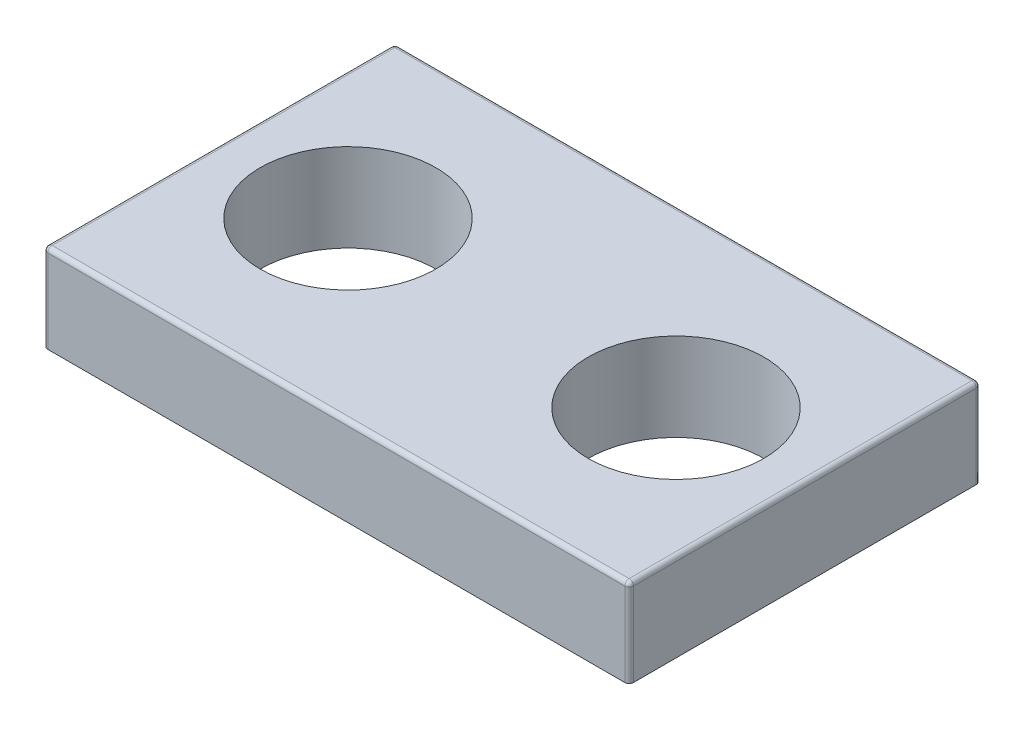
ISO-10303-21;
HEADER;
FILE_DESCRIPTION(('STEP AP214'),'2;1');
FILE_NAME('part.step','',(''),(''),'','','');
FILE_SCHEMA(('AUTOMOTIVE_DESIGN { 1 0 10303 214 1 1 1 1 }'));
ENDSEC;
DATA;
#1=APPLICATION_CONTEXT('core data for automotive mechanical design processes');
#2=APPLICATION_PROTOCOL_DEFINITION('international standard','automotive_design',2000,#1);
#3=PRODUCT_CONTEXT('',#1,'mechanical');
#4=PRODUCT('Part','Part','',(#3));
#5=PRODUCT_RELATED_PRODUCT_CATEGORY('part','',(#4));
#6=PRODUCT_DEFINITION_FORMATION('','',#4);
#7=PRODUCT_DEFINITION_CONTEXT('part definition',#1,'design');
#8=PRODUCT_DEFINITION('design','',#6,#7);
#9=PRODUCT_DEFINITION_SHAPE('','',#8);
#10=(LENGTH_UNIT() NAMED_UNIT(*) SI_UNIT(.MILLI.,.METRE.));
#11=(NAMED_UNIT(*) PLANE_ANGLE_UNIT() SI_UNIT($,.RADIAN.));
#12=(NAMED_UNIT(*) SI_UNIT($,.STERADIAN.) SOLID_ANGLE_UNIT());
#13=UNCERTAINTY_MEASURE_WITH_UNIT(LENGTH_MEASURE(1.E-05),#10,'distance_accuracy_value','');
#14=(GEOMETRIC_REPRESENTATION_CONTEXT(3) GLOBAL_UNCERTAINTY_ASSIGNED_CONTEXT((#13)) GLOBAL_UNIT_ASSIGNED_CONTEXT((#10,
#11,#12)) REPRESENTATION_CONTEXT('',''));
#15=CARTESIAN_POINT('',(0.,0.,0.));
#16=DIRECTION('',(0.,0.,1.));
#17=DIRECTION('',(1.,0.,0.));
#18=AXIS2_PLACEMENT_3D('',#15,#16,#17);
#19=CARTESIAN_POINT('',(0.,15.,0.));
#20=DIRECTION('',(0.,-1.,0.));
#21=DIRECTION('',(0.,0.,-1.));
#22=AXIS2_PLACEMENT_3D('',#19,#20,#21);
#23=PLANE('',#22);
#24=DIRECTION('',(1.,0.,0.));
#25=VECTOR('',#24,1.);
#26=CARTESIAN_POINT('',(0.,15.,29.25));
#27=LINE('',#26,#25);
#28=CARTESIAN_POINT('',(-49.25,15.,29.25));
#29=VERTEX_POINT('',#28);
#30=CARTESIAN_POINT('',(49.25,15.,29.25));
#31=VERTEX_POINT('',#30);
#32=EDGE_CURVE('E43',#29,#31,#27,.T.);
#33=ORIENTED_EDGE('',*,*,#32,.T.);
#34=DIRECTION('',(0.,0.,-1.));
#35=VECTOR('',#34,1.);
#36=CARTESIAN_POINT('',(49.25,15.,0.));
#37=LINE('',#36,#35);
#38=CARTESIAN_POINT('',(49.25,15.,-29.25));
#39=VERTEX_POINT('',#38);
#40=EDGE_CURVE('E11',#31,#39,#37,.T.);
#41=ORIENTED_EDGE('',*,*,#40,.T.);
#42=DIRECTION('',(-1.,0.,0.));
#43=VECTOR('',#42,1.);
#44=CARTESIAN_POINT('',(0.,15.,-29.25));
#45=LINE('',#44,#43);
#46=CARTESIAN_POINT('',(-49.25,15.,-29.25));
#47=VERTEX_POINT('',#46);
#48=EDGE_CURVE('E171',#39,#47,#45,.T.);
#49=ORIENTED_EDGE('',*,*,#48,.T.);
#50=DIRECTION('',(0.,0.,1.));
#51=VECTOR('',#50,1.);
#52=CARTESIAN_POINT('',(-49.25,15.,0.));
#53=LINE('',#52,#51);
#54=EDGE_CURVE('E169',#47,#29,#53,.T.);
#55=ORIENTED_EDGE('',*,*,#54,.T.);
#56=EDGE_LOOP('',(#33,#41,#49,#55));
#57=FACE_BOUND('',#56,.T.);
#58=CARTESIAN_POINT('',(-28.,15.,0.));
#59=DIRECTION('',(0.,1.,0.));
#60=DIRECTION('',(0.,0.,1.));
#61=AXIS2_PLACEMENT_3D('',#58,#59,#60);
#62=CIRCLE('',#61,15.);
#63=CARTESIAN_POINT('',(-28.,15.,15.));
#64=VERTEX_POINT('',#63);
#65=EDGE_CURVE('E217',#64,#64,#62,.T.);
#66=ORIENTED_EDGE('',*,*,#65,.F.);
#67=EDGE_LOOP('',(#66));
#68=FACE_BOUND('',#67,.T.);
#69=CARTESIAN_POINT('',(28.,15.,0.));
#70=DIRECTION('',(0.,1.,0.));
#71=DIRECTION('',(0.,0.,1.));
#72=AXIS2_PLACEMENT_3D('',#69,#70,#71);
#73=CIRCLE('',#72,15.);
#74=CARTESIAN_POINT('',(28.,15.,15.));
#75=VERTEX_POINT('',#74);
#76=EDGE_CURVE('E210',#75,#75,#73,.T.);
#77=ORIENTED_EDGE('',*,*,#76,.F.);
#78=EDGE_LOOP('',(#77));
#79=FACE_BOUND('',#78,.T.);
#80=ADVANCED_FACE('F34',(#57,#68,#79),#23,.F.);
#81=CARTESIAN_POINT('',(0.,0.,0.));
#82=DIRECTION('',(0.,-1.,0.));
#83=DIRECTION('',(0.,0.,-1.));
#84=AXIS2_PLACEMENT_3D('',#81,#82,#83);
#85=PLANE('',#84);
#86=CARTESIAN_POINT('',(-28.,0.,0.));
#87=DIRECTION('',(0.,1.,0.));
#88=DIRECTION('',(0.,0.,1.));
#89=AXIS2_PLACEMENT_3D('',#86,#87,#88);
#90=CIRCLE('',#89,15.);
#91=CARTESIAN_POINT('',(-28.,0.,15.));
#92=VERTEX_POINT('',#91);
#93=EDGE_CURVE('E214',#92,#92,#90,.T.);
#94=ORIENTED_EDGE('',*,*,#93,.T.);
#95=EDGE_LOOP('',(#94));
#96=FACE_BOUND('',#95,.T.);
#97=DIRECTION('',(1.,0.,0.));
#98=VECTOR('',#97,1.);
#99=CARTESIAN_POINT('',(-50.,0.,30.));
#100=LINE('',#99,#98);
#101=CARTESIAN_POINT('',(-49.25,0.,30.));
#102=VERTEX_POINT('',#101);
#103=CARTESIAN_POINT('',(49.25,0.,30.));
#104=VERTEX_POINT('',#103);
#105=EDGE_CURVE('E130',#102,#104,#100,.T.);
#106=ORIENTED_EDGE('',*,*,#105,.F.);
#107=CARTESIAN_POINT('',(-49.25,0.,29.25));
#108=DIRECTION('',(0.,-1.,0.));
#109=DIRECTION('',(0.,0.,-1.));
#110=AXIS2_PLACEMENT_3D('',#107,#108,#109);
#111=CIRCLE('',#110,0.75);
#112=CARTESIAN_POINT('',(-50.,0.,29.25));
#113=VERTEX_POINT('',#112);
#114=EDGE_CURVE('E114',#102,#113,#111,.T.);
#115=ORIENTED_EDGE('',*,*,#114,.T.);
#116=DIRECTION('',(0.,0.,1.));
#117=VECTOR('',#116,1.);
#118=CARTESIAN_POINT('',(-50.,0.,30.));
#119=LINE('',#118,#117);
#120=CARTESIAN_POINT('',(-50.,0.,-29.25));
#121=VERTEX_POINT('',#120);
#122=EDGE_CURVE('E141',#121,#113,#119,.T.);
#123=ORIENTED_EDGE('',*,*,#122,.F.);
#124=CARTESIAN_POINT('',(-49.25,0.,-29.25));
#125=DIRECTION('',(0.,-1.,0.));
#126=DIRECTION('',(0.,0.,-1.));
#127=AXIS2_PLACEMENT_3D('',#124,#125,#126);
#128=CIRCLE('',#127,0.75);
#129=CARTESIAN_POINT('',(-49.25,0.,-30.));
#130=VERTEX_POINT('',#129);
#131=EDGE_CURVE('E125',#121,#130,#128,.T.);
#132=ORIENTED_EDGE('',*,*,#131,.T.);
#133=DIRECTION('',(-1.,0.,0.));
#134=VECTOR('',#133,1.);
#135=CARTESIAN_POINT('',(-50.,0.,-30.));
#136=LINE('',#135,#134);
#137=CARTESIAN_POINT('',(49.25,0.,-30.));
#138=VERTEX_POINT('',#137);
#139=EDGE_CURVE('E144',#138,#130,#136,.T.);
#140=ORIENTED_EDGE('',*,*,#139,.F.);
#141=CARTESIAN_POINT('',(49.25,0.,-29.25));
#142=DIRECTION('',(0.,-1.,0.));
#143=DIRECTION('',(0.,0.,-1.));
#144=AXIS2_PLACEMENT_3D('',#141,#142,#143);
#145=CIRCLE('',#144,0.75);
#146=CARTESIAN_POINT('',(50.,0.,-29.25));
#147=VERTEX_POINT('',#146);
#148=EDGE_CURVE('E150',#138,#147,#145,.T.);
#149=ORIENTED_EDGE('',*,*,#148,.T.);
#150=DIRECTION('',(0.,0.,-1.));
#151=VECTOR('',#150,1.);
#152=CARTESIAN_POINT('',(50.,0.,30.));
#153=LINE('',#152,#151);
#154=CARTESIAN_POINT('',(50.,0.,29.25));
#155=VERTEX_POINT('',#154);
#156=EDGE_CURVE('E220',#155,#147,#153,.T.);
#157=ORIENTED_EDGE('',*,*,#156,.F.);
#158=CARTESIAN_POINT('',(49.25,0.,29.25));
#159=DIRECTION('',(0.,-1.,0.));
#160=DIRECTION('',(0.,0.,-1.));
#161=AXIS2_PLACEMENT_3D('',#158,#159,#160);
#162=CIRCLE('',#161,0.75);
#163=EDGE_CURVE('E134',#155,#104,#162,.T.);
#164=ORIENTED_EDGE('',*,*,#163,.T.);
#165=EDGE_LOOP('',(#106,#115,#123,#132,#140,#149,#157,#164));
#166=FACE_BOUND('',#165,.T.);
#167=CARTESIAN_POINT('',(28.,0.,0.));
#168=DIRECTION('',(0.,1.,0.));
#169=DIRECTION('',(0.,0.,1.));
#170=AXIS2_PLACEMENT_3D('',#167,#168,#169);
#171=CIRCLE('',#170,15.);
#172=CARTESIAN_POINT('',(28.,0.,15.));
#173=VERTEX_POINT('',#172);
#174=EDGE_CURVE('E205',#173,#173,#171,.T.);
#175=ORIENTED_EDGE('',*,*,#174,.T.);
#176=EDGE_LOOP('',(#175));
#177=FACE_BOUND('',#176,.T.);
#178=ADVANCED_FACE('F137',(#96,#166,#177),#85,.T.);
#179=CARTESIAN_POINT('',(50.,15.,30.));
#180=DIRECTION('',(-1.,0.,0.));
#181=DIRECTION('',(0.,0.,1.));
#182=AXIS2_PLACEMENT_3D('',#179,#180,#181);
#183=PLANE('',#182);
#184=ORIENTED_EDGE('',*,*,#156,.T.);
#185=DIRECTION('',(0.,-1.,0.));
#186=VECTOR('',#185,1.);
#187=CARTESIAN_POINT('',(50.,15.,-29.25));
#188=LINE('',#187,#186);
#189=CARTESIAN_POINT('',(50.,14.25,-29.25));
#190=VERTEX_POINT('',#189);
#191=EDGE_CURVE('E167',#147,#190,#188,.F.);
#192=ORIENTED_EDGE('',*,*,#191,.T.);
#193=DIRECTION('',(0.,0.,-1.));
#194=VECTOR('',#193,1.);
#195=CARTESIAN_POINT('',(50.,14.25,30.));
#196=LINE('',#195,#194);
#197=CARTESIAN_POINT('',(50.,14.25,29.25));
#198=VERTEX_POINT('',#197);
#199=EDGE_CURVE('E163',#190,#198,#196,.F.);
#200=ORIENTED_EDGE('',*,*,#199,.T.);
#201=DIRECTION('',(0.,-1.,0.));
#202=VECTOR('',#201,1.);
#203=CARTESIAN_POINT('',(50.,15.,29.25));
#204=LINE('',#203,#202);
#205=EDGE_CURVE('E165',#198,#155,#204,.T.);
#206=ORIENTED_EDGE('',*,*,#205,.T.);
#207=EDGE_LOOP('',(#184,#192,#200,#206));
#208=FACE_BOUND('',#207,.T.);
#209=ADVANCED_FACE('F245',(#208),#183,.F.);
#210=CARTESIAN_POINT('',(-50.,15.,-30.));
#211=DIRECTION('',(0.,0.,1.));
#212=DIRECTION('',(1.,0.,0.));
#213=AXIS2_PLACEMENT_3D('',#210,#211,#212);
#214=PLANE('',#213);
#215=ORIENTED_EDGE('',*,*,#139,.T.);
#216=DIRECTION('',(0.,-1.,0.));
#217=VECTOR('',#216,1.);
#218=CARTESIAN_POINT('',(-49.25,15.,-30.));
#219=LINE('',#218,#217);
#220=CARTESIAN_POINT('',(-49.25,14.25,-30.));
#221=VERTEX_POINT('',#220);
#222=EDGE_CURVE('E161',#130,#221,#219,.F.);
#223=ORIENTED_EDGE('',*,*,#222,.T.);
#224=DIRECTION('',(-1.,0.,0.));
#225=VECTOR('',#224,1.);
#226=CARTESIAN_POINT('',(-50.,14.25,-30.));
#227=LINE('',#226,#225);
#228=CARTESIAN_POINT('',(49.25,14.25,-30.));
#229=VERTEX_POINT('',#228);
#230=EDGE_CURVE('E157',#221,#229,#227,.F.);
#231=ORIENTED_EDGE('',*,*,#230,.T.);
#232=DIRECTION('',(0.,-1.,0.));
#233=VECTOR('',#232,1.);
#234=CARTESIAN_POINT('',(49.25,15.,-30.));
#235=LINE('',#234,#233);
#236=EDGE_CURVE('E159',#229,#138,#235,.T.);
#237=ORIENTED_EDGE('',*,*,#236,.T.);
#238=EDGE_LOOP('',(#215,#223,#231,#237));
#239=FACE_BOUND('',#238,.T.);
#240=ADVANCED_FACE('F228',(#239),#214,.F.);
#241=CARTESIAN_POINT('',(-50.,15.,30.));
#242=DIRECTION('',(1.,0.,0.));
#243=DIRECTION('',(0.,0.,-1.));
#244=AXIS2_PLACEMENT_3D('',#241,#242,#243);
#245=PLANE('',#244);
#246=ORIENTED_EDGE('',*,*,#122,.T.);
#247=DIRECTION('',(0.,-1.,0.));
#248=VECTOR('',#247,1.);
#249=CARTESIAN_POINT('',(-50.,15.,29.25));
#250=LINE('',#249,#248);
#251=CARTESIAN_POINT('',(-50.,14.25,29.25));
#252=VERTEX_POINT('',#251);
#253=EDGE_CURVE('E119',#113,#252,#250,.F.);
#254=ORIENTED_EDGE('',*,*,#253,.T.);
#255=DIRECTION('',(0.,0.,1.));
#256=VECTOR('',#255,1.);
#257=CARTESIAN_POINT('',(-50.,14.25,30.));
#258=LINE('',#257,#256);
#259=CARTESIAN_POINT('',(-50.,14.25,-29.25));
#260=VERTEX_POINT('',#259);
#261=EDGE_CURVE('E124',#252,#260,#258,.F.);
#262=ORIENTED_EDGE('',*,*,#261,.T.);
#263=DIRECTION('',(0.,-1.,0.));
#264=VECTOR('',#263,1.);
#265=CARTESIAN_POINT('',(-50.,15.,-29.25));
#266=LINE('',#265,#264);
#267=EDGE_CURVE('E154',#260,#121,#266,.T.);
#268=ORIENTED_EDGE('',*,*,#267,.T.);
#269=EDGE_LOOP('',(#246,#254,#262,#268));
#270=FACE_BOUND('',#269,.T.);
#271=ADVANCED_FACE('F265',(#270),#245,.F.);
#272=CARTESIAN_POINT('',(-50.,15.,30.));
#273=DIRECTION('',(0.,0.,-1.));
#274=DIRECTION('',(-1.,0.,0.));
#275=AXIS2_PLACEMENT_3D('',#272,#273,#274);
#276=PLANE('',#275);
#277=DIRECTION('',(1.,0.,0.));
#278=VECTOR('',#277,1.);
#279=CARTESIAN_POINT('',(-50.,14.25,30.));
#280=LINE('',#279,#278);
#281=CARTESIAN_POINT('',(49.25,14.25,30.));
#282=VERTEX_POINT('',#281);
#283=CARTESIAN_POINT('',(-49.25,14.25,30.));
#284=VERTEX_POINT('',#283);
#285=EDGE_CURVE('E132',#282,#284,#280,.F.);
#286=ORIENTED_EDGE('',*,*,#285,.T.);
#287=DIRECTION('',(0.,-1.,0.));
#288=VECTOR('',#287,1.);
#289=CARTESIAN_POINT('',(-49.25,15.,30.));
#290=LINE('',#289,#288);
#291=EDGE_CURVE('E118',#284,#102,#290,.T.);
#292=ORIENTED_EDGE('',*,*,#291,.T.);
#293=ORIENTED_EDGE('',*,*,#105,.T.);
#294=DIRECTION('',(0.,-1.,0.));
#295=VECTOR('',#294,1.);
#296=CARTESIAN_POINT('',(49.25,15.,30.));
#297=LINE('',#296,#295);
#298=EDGE_CURVE('E135',#104,#282,#297,.F.);
#299=ORIENTED_EDGE('',*,*,#298,.T.);
#300=EDGE_LOOP('',(#286,#292,#293,#299));
#301=FACE_BOUND('',#300,.T.);
#302=ADVANCED_FACE('F129',(#301),#276,.F.);
#303=CARTESIAN_POINT('',(-28.,15.,0.));
#304=DIRECTION('',(0.,-1.,0.));
#305=DIRECTION('',(0.,0.,-1.));
#306=AXIS2_PLACEMENT_3D('',#303,#304,#305);
#307=CYLINDRICAL_SURFACE('',#306,15.);
#308=ORIENTED_EDGE('',*,*,#65,.T.);
#309=EDGE_LOOP('',(#308));
#310=FACE_BOUND('',#309,.T.);
#311=ORIENTED_EDGE('',*,*,#93,.F.);
#312=EDGE_LOOP('',(#311));
#313=FACE_BOUND('',#312,.T.);
#314=ADVANCED_FACE('F272',(#310,#313),#307,.F.);
#315=CARTESIAN_POINT('',(28.,15.,0.));
#316=DIRECTION('',(0.,-1.,0.));
#317=DIRECTION('',(0.,0.,-1.));
#318=AXIS2_PLACEMENT_3D('',#315,#316,#317);
#319=CYLINDRICAL_SURFACE('',#318,15.);
#320=ORIENTED_EDGE('',*,*,#76,.T.);
#321=EDGE_LOOP('',(#320));
#322=FACE_BOUND('',#321,.T.);
#323=ORIENTED_EDGE('',*,*,#174,.F.);
#324=EDGE_LOOP('',(#323));
#325=FACE_BOUND('',#324,.T.);
#326=ADVANCED_FACE('F286',(#322,#325),#319,.F.);
#327=CARTESIAN_POINT('',(49.25,15.,-29.25));
#328=DIRECTION('',(0.,-1.,0.));
#329=DIRECTION('',(0.,0.,-1.));
#330=AXIS2_PLACEMENT_3D('',#327,#328,#329);
#331=CYLINDRICAL_SURFACE('',#330,0.75);
#332=CARTESIAN_POINT('',(49.25,14.25,-29.25));
#333=DIRECTION('',(0.,1.,0.));
#334=DIRECTION('',(0.,0.,1.));
#335=AXIS2_PLACEMENT_3D('',#332,#333,#334);
#336=CIRCLE('',#335,0.75);
#337=EDGE_CURVE('E38',#190,#229,#336,.T.);
#338=ORIENTED_EDGE('',*,*,#337,.F.);
#339=ORIENTED_EDGE('',*,*,#191,.F.);
#340=ORIENTED_EDGE('',*,*,#148,.F.);
#341=ORIENTED_EDGE('',*,*,#236,.F.);
#342=EDGE_LOOP('',(#338,#339,#340,#341));
#343=FACE_BOUND('',#342,.T.);
#344=ADVANCED_FACE('F36',(#343),#331,.T.);
#345=CARTESIAN_POINT('',(49.25,14.25,-29.25));
#346=DIRECTION('',(0.,0.,1.));
#347=DIRECTION('',(1.,0.,0.));
#348=AXIS2_PLACEMENT_3D('',#345,#346,#347);
#349=SPHERICAL_SURFACE('',#348,0.75);
#350=CARTESIAN_POINT('',(49.25,14.25,-29.25));
#351=DIRECTION('',(0.,0.,-1.));
#352=DIRECTION('',(-1.,0.,0.));
#353=AXIS2_PLACEMENT_3D('',#350,#351,#352);
#354=CIRCLE('',#353,0.75);
#355=EDGE_CURVE('E197',#190,#39,#354,.F.);
#356=ORIENTED_EDGE('',*,*,#355,.F.);
#357=ORIENTED_EDGE('',*,*,#337,.T.);
#358=CARTESIAN_POINT('',(49.25,14.25,-29.25));
#359=DIRECTION('',(1.,0.,0.));
#360=DIRECTION('',(0.,0.,-1.));
#361=AXIS2_PLACEMENT_3D('',#358,#359,#360);
#362=CIRCLE('',#361,0.75);
#363=EDGE_CURVE('E198',#39,#229,#362,.F.);
#364=ORIENTED_EDGE('',*,*,#363,.F.);
#365=EDGE_LOOP('',(#356,#357,#364));
#366=FACE_BOUND('',#365,.T.);
#367=ADVANCED_FACE('F293',(#366),#349,.T.);
#368=CARTESIAN_POINT('',(-49.25,15.,-29.25));
#369=DIRECTION('',(0.,-1.,0.));
#370=DIRECTION('',(0.,0.,-1.));
#371=AXIS2_PLACEMENT_3D('',#368,#369,#370);
#372=CYLINDRICAL_SURFACE('',#371,0.75);
#373=ORIENTED_EDGE('',*,*,#131,.F.);
#374=ORIENTED_EDGE('',*,*,#267,.F.);
#375=CARTESIAN_POINT('',(-49.25,14.25,-29.25));
#376=DIRECTION('',(0.,1.,0.));
#377=DIRECTION('',(0.,0.,1.));
#378=AXIS2_PLACEMENT_3D('',#375,#376,#377);
#379=CIRCLE('',#378,0.75);
#380=EDGE_CURVE('E194',#221,#260,#379,.T.);
#381=ORIENTED_EDGE('',*,*,#380,.F.);
#382=ORIENTED_EDGE('',*,*,#222,.F.);
#383=EDGE_LOOP('',(#373,#374,#381,#382));
#384=FACE_BOUND('',#383,.T.);
#385=ADVANCED_FACE('F234',(#384),#372,.T.);
#386=CARTESIAN_POINT('',(0.,14.25,-29.25));
#387=DIRECTION('',(-1.,0.,0.));
#388=DIRECTION('',(0.,0.,1.));
#389=AXIS2_PLACEMENT_3D('',#386,#387,#388);
#390=CYLINDRICAL_SURFACE('',#389,0.75);
#391=ORIENTED_EDGE('',*,*,#363,.T.);
#392=ORIENTED_EDGE('',*,*,#230,.F.);
#393=CARTESIAN_POINT('',(-49.25,14.25,-29.25));
#394=DIRECTION('',(-1.,0.,0.));
#395=DIRECTION('',(0.,0.,1.));
#396=AXIS2_PLACEMENT_3D('',#393,#394,#395);
#397=CIRCLE('',#396,0.75);
#398=EDGE_CURVE('E191',#47,#221,#397,.T.);
#399=ORIENTED_EDGE('',*,*,#398,.F.);
#400=ORIENTED_EDGE('',*,*,#48,.F.);
#401=EDGE_LOOP('',(#391,#392,#399,#400));
#402=FACE_BOUND('',#401,.T.);
#403=ADVANCED_FACE('F241',(#402),#390,.T.);
#404=CARTESIAN_POINT('',(49.25,14.25,0.));
#405=DIRECTION('',(0.,0.,-1.));
#406=DIRECTION('',(-1.,0.,0.));
#407=AXIS2_PLACEMENT_3D('',#404,#405,#406);
#408=CYLINDRICAL_SURFACE('',#407,0.75);
#409=ORIENTED_EDGE('',*,*,#355,.T.);
#410=ORIENTED_EDGE('',*,*,#40,.F.);
#411=CARTESIAN_POINT('',(49.25,14.25,29.25));
#412=DIRECTION('',(0.,0.,1.));
#413=DIRECTION('',(1.,0.,0.));
#414=AXIS2_PLACEMENT_3D('',#411,#412,#413);
#415=CIRCLE('',#414,0.75);
#416=EDGE_CURVE('E189',#198,#31,#415,.T.);
#417=ORIENTED_EDGE('',*,*,#416,.F.);
#418=ORIENTED_EDGE('',*,*,#199,.F.);
#419=EDGE_LOOP('',(#409,#410,#417,#418));
#420=FACE_BOUND('',#419,.T.);
#421=ADVANCED_FACE('F253',(#420),#408,.T.);
#422=CARTESIAN_POINT('',(49.25,15.,29.25));
#423=DIRECTION('',(0.,-1.,0.));
#424=DIRECTION('',(0.,0.,-1.));
#425=AXIS2_PLACEMENT_3D('',#422,#423,#424);
#426=CYLINDRICAL_SURFACE('',#425,0.75);
#427=ORIENTED_EDGE('',*,*,#163,.F.);
#428=ORIENTED_EDGE('',*,*,#205,.F.);
#429=CARTESIAN_POINT('',(49.25,14.25,29.25));
#430=DIRECTION('',(0.,1.,0.));
#431=DIRECTION('',(0.,0.,1.));
#432=AXIS2_PLACEMENT_3D('',#429,#430,#431);
#433=CIRCLE('',#432,0.75);
#434=EDGE_CURVE('E186',#282,#198,#433,.T.);
#435=ORIENTED_EDGE('',*,*,#434,.F.);
#436=ORIENTED_EDGE('',*,*,#298,.F.);
#437=EDGE_LOOP('',(#427,#428,#435,#436));
#438=FACE_BOUND('',#437,.T.);
#439=ADVANCED_FACE('F251',(#438),#426,.T.);
#440=CARTESIAN_POINT('',(-49.25,14.25,-29.25));
#441=DIRECTION('',(0.,0.,1.));
#442=DIRECTION('',(1.,0.,0.));
#443=AXIS2_PLACEMENT_3D('',#440,#441,#442);
#444=SPHERICAL_SURFACE('',#443,0.75);
#445=ORIENTED_EDGE('',*,*,#398,.T.);
#446=ORIENTED_EDGE('',*,*,#380,.T.);
#447=CARTESIAN_POINT('',(-49.25,14.25,-29.25));
#448=DIRECTION('',(0.,0.,-1.));
#449=DIRECTION('',(-1.,0.,0.));
#450=AXIS2_PLACEMENT_3D('',#447,#448,#449);
#451=CIRCLE('',#450,0.75);
#452=EDGE_CURVE('E183',#47,#260,#451,.F.);
#453=ORIENTED_EDGE('',*,*,#452,.F.);
#454=EDGE_LOOP('',(#445,#446,#453));
#455=FACE_BOUND('',#454,.T.);
#456=ADVANCED_FACE('F239',(#455),#444,.T.);
#457=CARTESIAN_POINT('',(49.25,14.25,29.25));
#458=DIRECTION('',(0.,0.,1.));
#459=DIRECTION('',(1.,0.,0.));
#460=AXIS2_PLACEMENT_3D('',#457,#458,#459);
#461=SPHERICAL_SURFACE('',#460,0.75);
#462=ORIENTED_EDGE('',*,*,#434,.T.);
#463=ORIENTED_EDGE('',*,*,#416,.T.);
#464=CARTESIAN_POINT('',(49.25,14.25,29.25));
#465=DIRECTION('',(1.,0.,0.));
#466=DIRECTION('',(0.,0.,-1.));
#467=AXIS2_PLACEMENT_3D('',#464,#465,#466);
#468=CIRCLE('',#467,0.75);
#469=EDGE_CURVE('E51',#282,#31,#468,.F.);
#470=ORIENTED_EDGE('',*,*,#469,.F.);
#471=EDGE_LOOP('',(#462,#463,#470));
#472=FACE_BOUND('',#471,.T.);
#473=ADVANCED_FACE('F255',(#472),#461,.T.);
#474=CARTESIAN_POINT('',(-49.25,14.25,0.));
#475=DIRECTION('',(0.,0.,1.));
#476=DIRECTION('',(1.,0.,0.));
#477=AXIS2_PLACEMENT_3D('',#474,#475,#476);
#478=CYLINDRICAL_SURFACE('',#477,0.75);
#479=ORIENTED_EDGE('',*,*,#452,.T.);
#480=ORIENTED_EDGE('',*,*,#261,.F.);
#481=CARTESIAN_POINT('',(-49.25,14.25,29.25));
#482=DIRECTION('',(0.,0.,1.));
#483=DIRECTION('',(1.,0.,0.));
#484=AXIS2_PLACEMENT_3D('',#481,#482,#483);
#485=CIRCLE('',#484,0.75);
#486=EDGE_CURVE('E179',#29,#252,#485,.T.);
#487=ORIENTED_EDGE('',*,*,#486,.F.);
#488=ORIENTED_EDGE('',*,*,#54,.F.);
#489=EDGE_LOOP('',(#479,#480,#487,#488));
#490=FACE_BOUND('',#489,.T.);
#491=ADVANCED_FACE('F263',(#490),#478,.T.);
#492=CARTESIAN_POINT('',(0.,14.25,29.25));
#493=DIRECTION('',(1.,0.,0.));
#494=DIRECTION('',(0.,0.,-1.));
#495=AXIS2_PLACEMENT_3D('',#492,#493,#494);
#496=CYLINDRICAL_SURFACE('',#495,0.75);
#497=ORIENTED_EDGE('',*,*,#469,.T.);
#498=ORIENTED_EDGE('',*,*,#32,.F.);
#499=CARTESIAN_POINT('',(-49.25,14.25,29.25));
#500=DIRECTION('',(-1.,0.,0.));
#501=DIRECTION('',(0.,0.,1.));
#502=AXIS2_PLACEMENT_3D('',#499,#500,#501);
#503=CIRCLE('',#502,0.75);
#504=EDGE_CURVE('E176',#284,#29,#503,.T.);
#505=ORIENTED_EDGE('',*,*,#504,.F.);
#506=ORIENTED_EDGE('',*,*,#285,.F.);
#507=EDGE_LOOP('',(#497,#498,#505,#506));
#508=FACE_BOUND('',#507,.T.);
#509=ADVANCED_FACE('F256',(#508),#496,.T.);
#510=CARTESIAN_POINT('',(-49.25,14.25,29.25));
#511=DIRECTION('',(0.,0.,1.));
#512=DIRECTION('',(1.,0.,0.));
#513=AXIS2_PLACEMENT_3D('',#510,#511,#512);
#514=SPHERICAL_SURFACE('',#513,0.75);
#515=ORIENTED_EDGE('',*,*,#504,.T.);
#516=ORIENTED_EDGE('',*,*,#486,.T.);
#517=CARTESIAN_POINT('',(-49.25,14.25,29.25));
#518=DIRECTION('',(0.,1.,0.));
#519=DIRECTION('',(0.,0.,1.));
#520=AXIS2_PLACEMENT_3D('',#517,#518,#519);
#521=CIRCLE('',#520,0.75);
#522=EDGE_CURVE('E174',#284,#252,#521,.F.);
#523=ORIENTED_EDGE('',*,*,#522,.F.);
#524=EDGE_LOOP('',(#515,#516,#523));
#525=FACE_BOUND('',#524,.T.);
#526=ADVANCED_FACE('F260',(#525),#514,.T.);
#527=CARTESIAN_POINT('',(-49.25,15.,29.25));
#528=DIRECTION('',(0.,-1.,0.));
#529=DIRECTION('',(0.,0.,-1.));
#530=AXIS2_PLACEMENT_3D('',#527,#528,#529);
#531=CYLINDRICAL_SURFACE('',#530,0.75);
#532=ORIENTED_EDGE('',*,*,#522,.T.);
#533=ORIENTED_EDGE('',*,*,#253,.F.);
#534=ORIENTED_EDGE('',*,*,#114,.F.);
#535=ORIENTED_EDGE('',*,*,#291,.F.);
#536=EDGE_LOOP('',(#532,#533,#534,#535));
#537=FACE_BOUND('',#536,.T.);
#538=ADVANCED_FACE('F117',(#537),#531,.T.);
#539=CLOSED_SHELL('',(#80,#178,#209,#240,#271,#302,#314,#326,#344,#367,#385,#403,#421,#439,#456,
#473,#491,#509,#526,#538));
#540=MANIFOLD_SOLID_BREP('B2',#539);
#541=ADVANCED_BREP_SHAPE_REPRESENTATION('',(#18,#540),#14);
#542=SHAPE_DEFINITION_REPRESENTATION(#9,#541);
ENDSEC;
END-ISO-10303-21;
